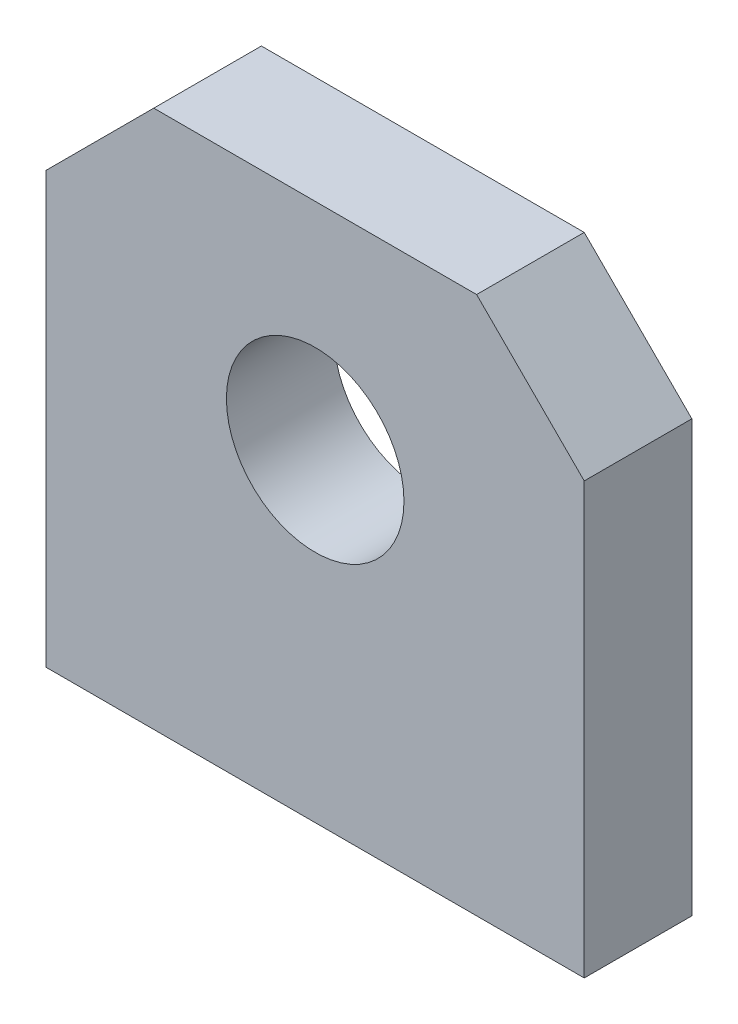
ISO-10303-21;
HEADER;
FILE_DESCRIPTION(('STEP AP214'),'2;1');
FILE_NAME('part.step','',(''),(''),'','','');
FILE_SCHEMA(('AUTOMOTIVE_DESIGN { 1 0 10303 214 1 1 1 1 }'));
ENDSEC;
DATA;
#1=APPLICATION_CONTEXT('core data for automotive mechanical design processes');
#2=APPLICATION_PROTOCOL_DEFINITION('international standard','automotive_design',2000,#1);
#3=PRODUCT_CONTEXT('',#1,'mechanical');
#4=PRODUCT('Part','Part','',(#3));
#5=PRODUCT_RELATED_PRODUCT_CATEGORY('part','',(#4));
#6=PRODUCT_DEFINITION_FORMATION('','',#4);
#7=PRODUCT_DEFINITION_CONTEXT('part definition',#1,'design');
#8=PRODUCT_DEFINITION('design','',#6,#7);
#9=PRODUCT_DEFINITION_SHAPE('','',#8);
#10=(LENGTH_UNIT() NAMED_UNIT(*) SI_UNIT(.MILLI.,.METRE.));
#11=(NAMED_UNIT(*) PLANE_ANGLE_UNIT() SI_UNIT($,.RADIAN.));
#12=(NAMED_UNIT(*) SI_UNIT($,.STERADIAN.) SOLID_ANGLE_UNIT());
#13=UNCERTAINTY_MEASURE_WITH_UNIT(LENGTH_MEASURE(1.E-05),#10,'distance_accuracy_value','');
#14=(GEOMETRIC_REPRESENTATION_CONTEXT(3) GLOBAL_UNCERTAINTY_ASSIGNED_CONTEXT((#13)) GLOBAL_UNIT_ASSIGNED_CONTEXT((#10,
#11,#12)) REPRESENTATION_CONTEXT('',''));
#15=CARTESIAN_POINT('',(0.,0.,0.));
#16=DIRECTION('',(0.,0.,1.));
#17=DIRECTION('',(1.,0.,0.));
#18=AXIS2_PLACEMENT_3D('',#15,#16,#17);
#19=CARTESIAN_POINT('',(0.,0.,10.));
#20=DIRECTION('',(0.,0.,-1.));
#21=DIRECTION('',(-1.,0.,0.));
#22=AXIS2_PLACEMENT_3D('',#19,#20,#21);
#23=PLANE('',#22);
#24=DIRECTION('',(-1.,0.,0.));
#25=VECTOR('',#24,1.);
#26=CARTESIAN_POINT('',(0.,50.,10.));
#27=LINE('',#26,#25);
#28=CARTESIAN_POINT('',(40.,50.,10.));
#29=VERTEX_POINT('',#28);
#30=CARTESIAN_POINT('',(10.,50.,10.));
#31=VERTEX_POINT('',#30);
#32=EDGE_CURVE('E115',#29,#31,#27,.T.);
#33=ORIENTED_EDGE('',*,*,#32,.T.);
#34=DIRECTION('',(0.707106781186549,0.707106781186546,0.));
#35=VECTOR('',#34,1.);
#36=CARTESIAN_POINT('',(0.,40.,10.));
#37=LINE('',#36,#35);
#38=CARTESIAN_POINT('',(0.,40.,10.));
#39=VERTEX_POINT('',#38);
#40=EDGE_CURVE('E41',#31,#39,#37,.F.);
#41=ORIENTED_EDGE('',*,*,#40,.T.);
#42=DIRECTION('',(0.,-1.,0.));
#43=VECTOR('',#42,1.);
#44=CARTESIAN_POINT('',(0.,0.,10.));
#45=LINE('',#44,#43);
#46=CARTESIAN_POINT('',(0.,0.,10.));
#47=VERTEX_POINT('',#46);
#48=EDGE_CURVE('E87',#39,#47,#45,.T.);
#49=ORIENTED_EDGE('',*,*,#48,.T.);
#50=DIRECTION('',(1.,0.,0.));
#51=VECTOR('',#50,1.);
#52=CARTESIAN_POINT('',(0.,0.,10.));
#53=LINE('',#52,#51);
#54=CARTESIAN_POINT('',(50.,0.,10.));
#55=VERTEX_POINT('',#54);
#56=EDGE_CURVE('E90',#47,#55,#53,.T.);
#57=ORIENTED_EDGE('',*,*,#56,.T.);
#58=DIRECTION('',(0.,1.,0.));
#59=VECTOR('',#58,1.);
#60=CARTESIAN_POINT('',(50.,0.,10.));
#61=LINE('',#60,#59);
#62=CARTESIAN_POINT('',(50.,40.,10.));
#63=VERTEX_POINT('',#62);
#64=EDGE_CURVE('E105',#55,#63,#61,.T.);
#65=ORIENTED_EDGE('',*,*,#64,.T.);
#66=DIRECTION('',(0.707106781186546,-0.707106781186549,0.));
#67=VECTOR('',#66,1.);
#68=CARTESIAN_POINT('',(40.,50.,10.));
#69=LINE('',#68,#67);
#70=EDGE_CURVE('E126',#63,#29,#69,.F.);
#71=ORIENTED_EDGE('',*,*,#70,.T.);
#72=EDGE_LOOP('',(#33,#41,#49,#57,#65,#71));
#73=FACE_BOUND('',#72,.T.);
#74=CARTESIAN_POINT('',(25.,30.,10.));
#75=DIRECTION('',(0.,0.,1.));
#76=DIRECTION('',(1.,0.,0.));
#77=AXIS2_PLACEMENT_3D('',#74,#75,#76);
#78=CIRCLE('',#77,8.25);
#79=CARTESIAN_POINT('',(33.25,30.,10.));
#80=VERTEX_POINT('',#79);
#81=EDGE_CURVE('E143',#80,#80,#78,.T.);
#82=ORIENTED_EDGE('',*,*,#81,.F.);
#83=EDGE_LOOP('',(#82));
#84=FACE_BOUND('',#83,.T.);
#85=ADVANCED_FACE('F33',(#73,#84),#23,.F.);
#86=CARTESIAN_POINT('',(0.,0.,0.));
#87=DIRECTION('',(0.,0.,-1.));
#88=DIRECTION('',(-1.,0.,0.));
#89=AXIS2_PLACEMENT_3D('',#86,#87,#88);
#90=PLANE('',#89);
#91=DIRECTION('',(0.,-1.,0.));
#92=VECTOR('',#91,1.);
#93=CARTESIAN_POINT('',(0.,0.,0.));
#94=LINE('',#93,#92);
#95=CARTESIAN_POINT('',(0.,40.,0.));
#96=VERTEX_POINT('',#95);
#97=CARTESIAN_POINT('',(0.,0.,0.));
#98=VERTEX_POINT('',#97);
#99=EDGE_CURVE('E109',#96,#98,#94,.T.);
#100=ORIENTED_EDGE('',*,*,#99,.F.);
#101=DIRECTION('',(-0.707106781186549,-0.707106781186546,0.));
#102=VECTOR('',#101,1.);
#103=CARTESIAN_POINT('',(-20.,20.0000000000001,0.));
#104=LINE('',#103,#102);
#105=CARTESIAN_POINT('',(10.,50.,0.));
#106=VERTEX_POINT('',#105);
#107=EDGE_CURVE('E120',#96,#106,#104,.F.);
#108=ORIENTED_EDGE('',*,*,#107,.T.);
#109=DIRECTION('',(-1.,0.,0.));
#110=VECTOR('',#109,1.);
#111=CARTESIAN_POINT('',(0.,50.,0.));
#112=LINE('',#111,#110);
#113=CARTESIAN_POINT('',(40.,50.,0.));
#114=VERTEX_POINT('',#113);
#115=EDGE_CURVE('E97',#114,#106,#112,.T.);
#116=ORIENTED_EDGE('',*,*,#115,.F.);
#117=DIRECTION('',(-0.707106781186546,0.707106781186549,0.));
#118=VECTOR('',#117,1.);
#119=CARTESIAN_POINT('',(45.0000000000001,44.9999999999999,0.));
#120=LINE('',#119,#118);
#121=CARTESIAN_POINT('',(50.,40.,0.));
#122=VERTEX_POINT('',#121);
#123=EDGE_CURVE('E113',#114,#122,#120,.F.);
#124=ORIENTED_EDGE('',*,*,#123,.T.);
#125=DIRECTION('',(0.,1.,0.));
#126=VECTOR('',#125,1.);
#127=CARTESIAN_POINT('',(50.,0.,0.));
#128=LINE('',#127,#126);
#129=CARTESIAN_POINT('',(50.,0.,0.));
#130=VERTEX_POINT('',#129);
#131=EDGE_CURVE('E137',#130,#122,#128,.T.);
#132=ORIENTED_EDGE('',*,*,#131,.F.);
#133=DIRECTION('',(1.,0.,0.));
#134=VECTOR('',#133,1.);
#135=CARTESIAN_POINT('',(0.,0.,0.));
#136=LINE('',#135,#134);
#137=EDGE_CURVE('E139',#98,#130,#136,.T.);
#138=ORIENTED_EDGE('',*,*,#137,.F.);
#139=EDGE_LOOP('',(#100,#108,#116,#124,#132,#138));
#140=FACE_BOUND('',#139,.T.);
#141=CARTESIAN_POINT('',(25.,30.,0.));
#142=DIRECTION('',(0.,0.,1.));
#143=DIRECTION('',(1.,0.,0.));
#144=AXIS2_PLACEMENT_3D('',#141,#142,#143);
#145=CIRCLE('',#144,8.25);
#146=CARTESIAN_POINT('',(33.25,30.,0.));
#147=VERTEX_POINT('',#146);
#148=EDGE_CURVE('E146',#147,#147,#145,.T.);
#149=ORIENTED_EDGE('',*,*,#148,.T.);
#150=EDGE_LOOP('',(#149));
#151=FACE_BOUND('',#150,.T.);
#152=ADVANCED_FACE('F135',(#140,#151),#90,.T.);
#153=CARTESIAN_POINT('',(0.,0.,10.));
#154=DIRECTION('',(1.,0.,0.));
#155=DIRECTION('',(0.,0.,-1.));
#156=AXIS2_PLACEMENT_3D('',#153,#154,#155);
#157=PLANE('',#156);
#158=ORIENTED_EDGE('',*,*,#48,.F.);
#159=DIRECTION('',(0.,0.,-1.));
#160=VECTOR('',#159,1.);
#161=CARTESIAN_POINT('',(0.,40.,10.));
#162=LINE('',#161,#160);
#163=EDGE_CURVE('E111',#39,#96,#162,.T.);
#164=ORIENTED_EDGE('',*,*,#163,.T.);
#165=ORIENTED_EDGE('',*,*,#99,.T.);
#166=DIRECTION('',(0.,0.,-1.));
#167=VECTOR('',#166,1.);
#168=CARTESIAN_POINT('',(0.,0.,10.));
#169=LINE('',#168,#167);
#170=EDGE_CURVE('E102',#47,#98,#169,.T.);
#171=ORIENTED_EDGE('',*,*,#170,.F.);
#172=EDGE_LOOP('',(#158,#164,#165,#171));
#173=FACE_BOUND('',#172,.T.);
#174=ADVANCED_FACE('F107',(#173),#157,.F.);
#175=CARTESIAN_POINT('',(0.,0.,10.));
#176=DIRECTION('',(0.,1.,0.));
#177=DIRECTION('',(0.,0.,1.));
#178=AXIS2_PLACEMENT_3D('',#175,#176,#177);
#179=PLANE('',#178);
#180=ORIENTED_EDGE('',*,*,#137,.T.);
#181=DIRECTION('',(0.,0.,-1.));
#182=VECTOR('',#181,1.);
#183=CARTESIAN_POINT('',(50.,0.,10.));
#184=LINE('',#183,#182);
#185=EDGE_CURVE('E104',#55,#130,#184,.T.);
#186=ORIENTED_EDGE('',*,*,#185,.F.);
#187=ORIENTED_EDGE('',*,*,#56,.F.);
#188=ORIENTED_EDGE('',*,*,#170,.T.);
#189=EDGE_LOOP('',(#180,#186,#187,#188));
#190=FACE_BOUND('',#189,.T.);
#191=ADVANCED_FACE('F101',(#190),#179,.F.);
#192=CARTESIAN_POINT('',(50.,0.,10.));
#193=DIRECTION('',(-1.,0.,0.));
#194=DIRECTION('',(0.,0.,1.));
#195=AXIS2_PLACEMENT_3D('',#192,#193,#194);
#196=PLANE('',#195);
#197=ORIENTED_EDGE('',*,*,#131,.T.);
#198=DIRECTION('',(0.,0.,1.));
#199=VECTOR('',#198,1.);
#200=CARTESIAN_POINT('',(50.,40.,10.));
#201=LINE('',#200,#199);
#202=EDGE_CURVE('E11',#122,#63,#201,.T.);
#203=ORIENTED_EDGE('',*,*,#202,.T.);
#204=ORIENTED_EDGE('',*,*,#64,.F.);
#205=ORIENTED_EDGE('',*,*,#185,.T.);
#206=EDGE_LOOP('',(#197,#203,#204,#205));
#207=FACE_BOUND('',#206,.T.);
#208=ADVANCED_FACE('F138',(#207),#196,.F.);
#209=CARTESIAN_POINT('',(0.,50.,10.));
#210=DIRECTION('',(0.,-1.,0.));
#211=DIRECTION('',(0.,0.,-1.));
#212=AXIS2_PLACEMENT_3D('',#209,#210,#211);
#213=PLANE('',#212);
#214=ORIENTED_EDGE('',*,*,#115,.T.);
#215=DIRECTION('',(0.,0.,1.));
#216=VECTOR('',#215,1.);
#217=CARTESIAN_POINT('',(10.,50.,10.));
#218=LINE('',#217,#216);
#219=EDGE_CURVE('E54',#106,#31,#218,.T.);
#220=ORIENTED_EDGE('',*,*,#219,.T.);
#221=ORIENTED_EDGE('',*,*,#32,.F.);
#222=DIRECTION('',(0.,0.,-1.));
#223=VECTOR('',#222,1.);
#224=CARTESIAN_POINT('',(40.,50.,10.));
#225=LINE('',#224,#223);
#226=EDGE_CURVE('E122',#29,#114,#225,.T.);
#227=ORIENTED_EDGE('',*,*,#226,.T.);
#228=EDGE_LOOP('',(#214,#220,#221,#227));
#229=FACE_BOUND('',#228,.T.);
#230=ADVANCED_FACE('F130',(#229),#213,.F.);
#231=CARTESIAN_POINT('',(25.,30.,10.));
#232=DIRECTION('',(0.,0.,-1.));
#233=DIRECTION('',(-1.,0.,0.));
#234=AXIS2_PLACEMENT_3D('',#231,#232,#233);
#235=CYLINDRICAL_SURFACE('',#234,8.25);
#236=ORIENTED_EDGE('',*,*,#81,.T.);
#237=EDGE_LOOP('',(#236));
#238=FACE_BOUND('',#237,.T.);
#239=ORIENTED_EDGE('',*,*,#148,.F.);
#240=EDGE_LOOP('',(#239));
#241=FACE_BOUND('',#240,.T.);
#242=ADVANCED_FACE('F152',(#238,#241),#235,.F.);
#243=CARTESIAN_POINT('',(0.,40.,10.));
#244=DIRECTION('',(0.707106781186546,-0.707106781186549,0.));
#245=DIRECTION('',(0.,0.,-1.));
#246=AXIS2_PLACEMENT_3D('',#243,#244,#245);
#247=PLANE('',#246);
#248=ORIENTED_EDGE('',*,*,#40,.F.);
#249=ORIENTED_EDGE('',*,*,#219,.F.);
#250=ORIENTED_EDGE('',*,*,#107,.F.);
#251=ORIENTED_EDGE('',*,*,#163,.F.);
#252=EDGE_LOOP('',(#248,#249,#250,#251));
#253=FACE_BOUND('',#252,.T.);
#254=ADVANCED_FACE('F169',(#253),#247,.F.);
#255=CARTESIAN_POINT('',(40.,50.,10.));
#256=DIRECTION('',(-0.707106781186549,-0.707106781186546,0.));
#257=DIRECTION('',(0.,0.,-1.));
#258=AXIS2_PLACEMENT_3D('',#255,#256,#257);
#259=PLANE('',#258);
#260=ORIENTED_EDGE('',*,*,#70,.F.);
#261=ORIENTED_EDGE('',*,*,#202,.F.);
#262=ORIENTED_EDGE('',*,*,#123,.F.);
#263=ORIENTED_EDGE('',*,*,#226,.F.);
#264=EDGE_LOOP('',(#260,#261,#262,#263));
#265=FACE_BOUND('',#264,.T.);
#266=ADVANCED_FACE('F35',(#265),#259,.F.);
#267=CLOSED_SHELL('',(#85,#152,#174,#191,#208,#230,#242,#254,#266));
#268=MANIFOLD_SOLID_BREP('B2',#267);
#269=ADVANCED_BREP_SHAPE_REPRESENTATION('',(#18,#268),#14);
#270=SHAPE_DEFINITION_REPRESENTATION(#9,#269);
ENDSEC;
END-ISO-10303-21;
